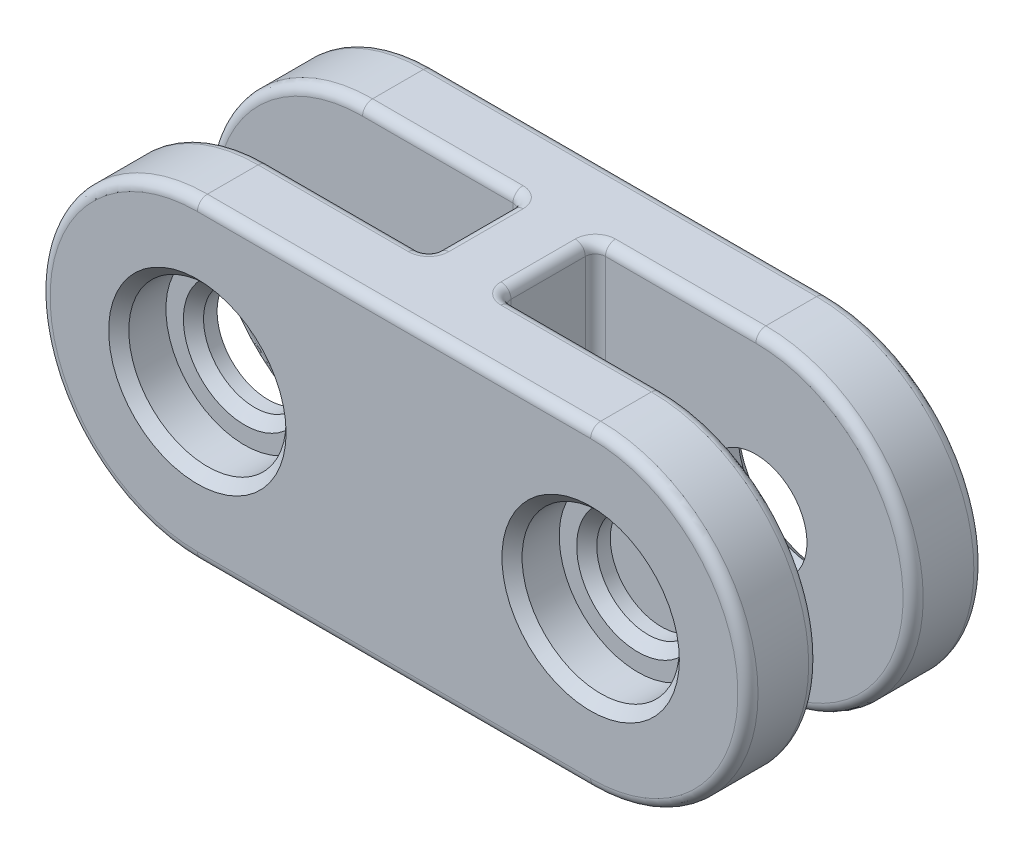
from build123d import *

# Parameters (mm, degrees)
SKETCH1_R           = 4.1275
BOSS_EXTRUDE1_DEPTH = 9.525
SKETCH2_R           = 6.35
CUT_EXTRUDE1_DEPTH  = 3.81
SKETCH3_W           = 25.654
SKETCH3_H           = 7.62
CUT_EXTRUDE3_DEPTH  = 53.073871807
FILLET1_R           = 0.8128
CHAMFER1_SIZE       = 0.8128


with BuildPart() as part:
    # Sketch1 → Boss-Extrude1 (new, symmetric)
    with BuildSketch(Plane.XY):
        with BuildLine():
            Line((0, 12.7), (31.75, 12.7))
            ThreePointArc((31.75, 12.7), (44.45, 0), (31.75, -12.7))
            Line((31.75, -12.7), (0, -12.7))
            ThreePointArc((0, -12.7), (-12.7, 0), (0, 12.7))
        make_face()
        with Locations(Location((0, 0, 0), (0, 0, 180))):
            Circle(SKETCH1_R, mode=Mode.SUBTRACT)
        with Locations(Location((31.75, 0, 0), (0, 0, 180))):
            Circle(SKETCH1_R, mode=Mode.SUBTRACT)
    extrude(amount=BOSS_EXTRUDE1_DEPTH, both=True)

    # Sketch2 → Cut-Extrude1 (cut)
    with BuildSketch(Plane.XY.offset(9.525)):
        with Locations((31.75, 0)):
            Circle(SKETCH2_R)
        Circle(SKETCH2_R)
    cut_extrude1 = extrude(amount=-CUT_EXTRUDE1_DEPTH, mode=Mode.SUBTRACT)

    # Mirror1: Cut-Extrude1 across plane
    add(cut_extrude1.mirror(Plane.XY), mode=Mode.SUBTRACT)

    # Sketch3 → Cut-Extrude3 (cut, through all)
    with BuildSketch(Plane(origin=(0, 12.7, 0), x_dir=(1, 0, 0), z_dir=(0, 1, 0))):
        with Locations((0.127, 0)):
            Rectangle(SKETCH3_W, SKETCH3_H)
        with Locations((31.623, 0)):
            Rectangle(SKETCH3_W, SKETCH3_H)
    extrude(amount=-CUT_EXTRUDE3_DEPTH, mode=Mode.SUBTRACT)

    # Fillet1
    fillet1_edges = [part.edges().sort_by_distance(p)[0] for p in [
        (44.45, 0, 9.525),
        (15.875, 12.7, 9.525),
        (-12.7, 0, 9.525),
        (15.875, 12.7, -9.525),
        (25.273, 12.7, -3.81),
        (44.45, 0, -9.525),
        (15.875, -12.7, -9.525),
        (44.45, 0, 3.81),
        (25.273, -12.7, 3.81),
        (44.45, 0, -3.81),
        (25.273, -12.7, -3.81),
        (18.796, 0, -3.81),
        (18.796, -12.7, 0),
        (18.796, 0, 3.81),
        (25.273, 12.7, 3.81),
        (-12.7, 0, -9.525),
        (18.796, 12.7, 0),
        (6.477, 12.7, 3.81),
        (15.875, -12.7, 9.525),
        (12.954, 12.7, 0),
        (6.477, 12.7, -3.81),
        (-12.7, 0, -3.81),
        (6.477, -12.7, -3.81),
        (-12.7, 0, 3.81),
        (6.477, -12.7, 3.81),
        (12.954, 0, 3.81),
        (12.954, -12.7, 0),
        (12.954, 0, -3.81),
    ]]
    fillet(fillet1_edges, radius=FILLET1_R)

    # Chamfer1
    chamfer1_edges = [part.edges().sort_by_distance(p)[0] for p in [
        (35.8775, 0, 5.715),
        (25.4, 0, 9.525),
        (4.1275, 0, 5.715),
        (-6.35, 0, 9.525),
        (25.4, 0, -9.525),
        (35.8775, 0, -5.715),
        (-6.35, 0, -9.525),
        (4.1275, 0, -5.715),
    ]]
    chamfer(chamfer1_edges, length=CHAMFER1_SIZE)


solid = part.part
